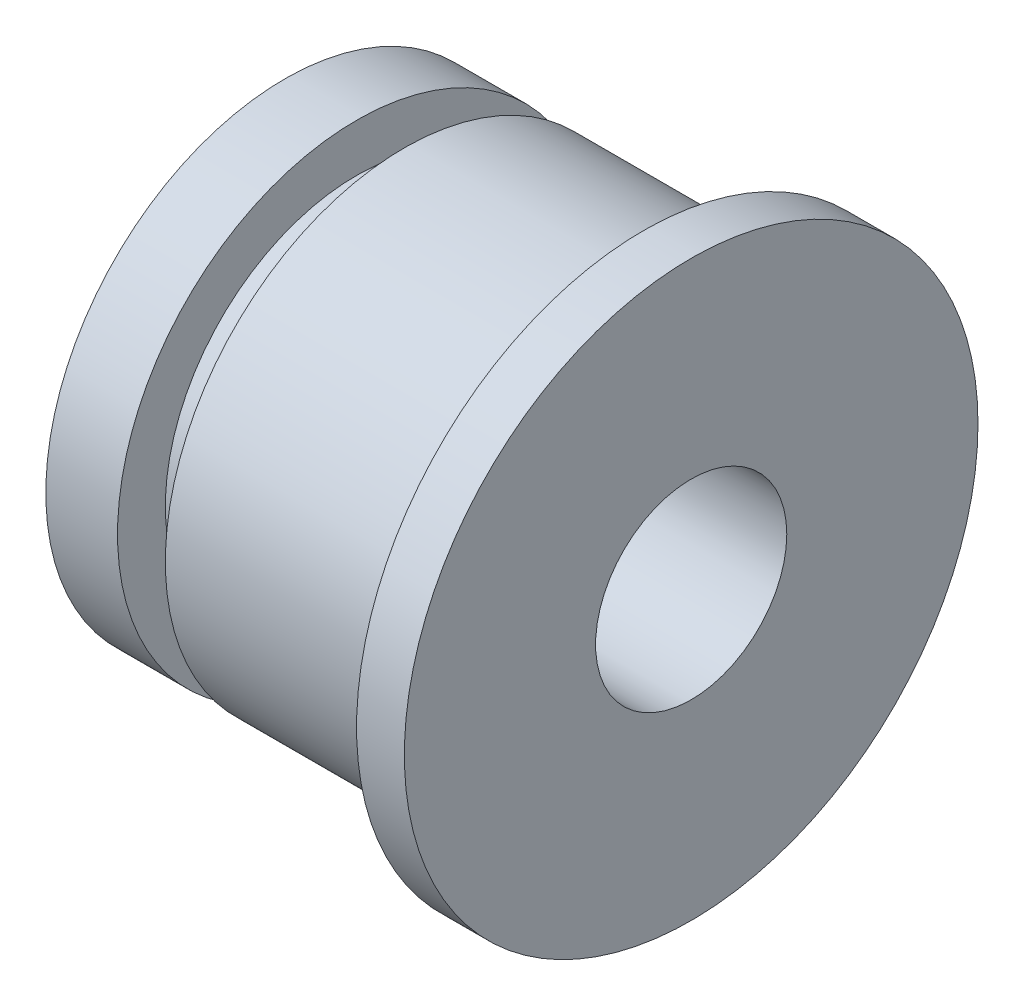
from build123d import *


with BuildPart() as part:
    # Esquisse1 → R_volution1 (revolve)
    with BuildSketch(Plane.XY, mode=Mode.PRIVATE) as r_volution1_sk:
        Polygon((11.5, -5), (13, -5), (13, -4), (14, -4), (14, -5), (19, -5), (19, -6), (20, -6), (20, -2), (11.5, -2), align=None)
    revolve(r_volution1_sk.sketch.rotate(Axis((23, 0, 0), (-1, 0, 0)), 270), axis=Axis((23, 0, 0), (-1, 0, 0)))


solid = part.part
